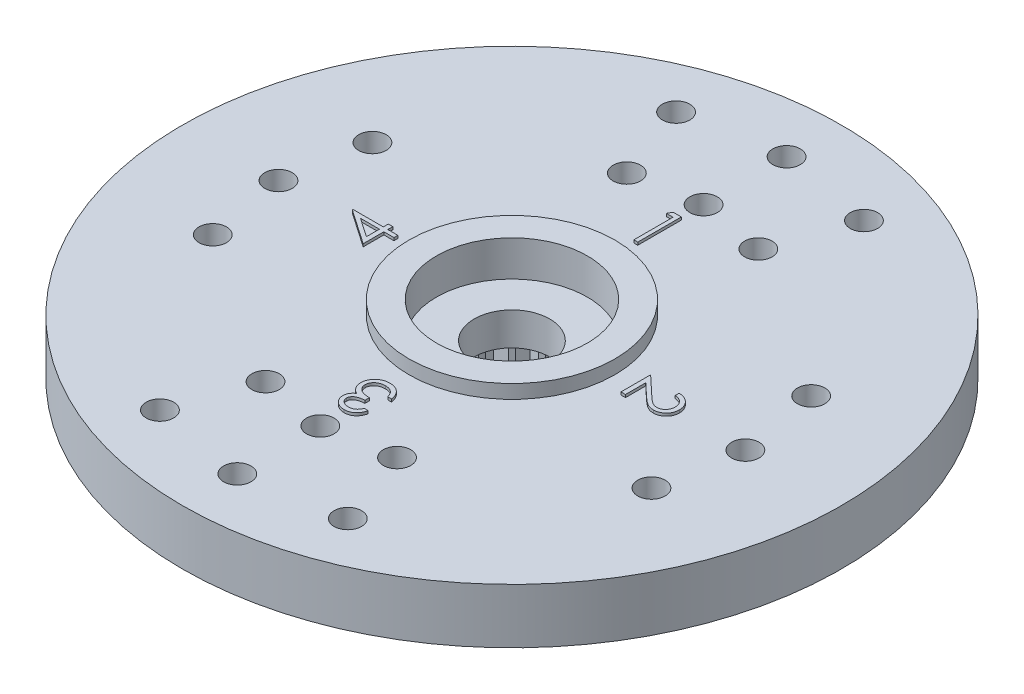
from build123d import *

# Parameters (mm, degrees)
SKETCH1_R           = 12
SKETCH1_R_2         = 1.375
SKETCH1_R_3         = 0.5
BOSS_EXTRUDE1_DEPTH = 2
SKETCH2_R           = 3.75
SKETCH2_R_2         = 2.75
BOSS_EXTRUDE2_DEPTH = 0.5
CUT_EXTRUDE1_START  = -0.8
SKETCH3_R           = 2.75
SKETCH3_R_2         = 1.375
CUT_EXTRUDE1_DEPTH  = 0.8
SKETCH4_R           = 4.5
SKETCH4_R_2         = 2.5
BOSS_EXTRUDE3_DEPTH = 2.5
CUT_EXTRUDE3_START  = -2.5
CUT_EXTRUDE3_DEPTH  = 2.5
BOSS_EXTRUDE4_DEPTH = 0.1


with BuildPart() as part:
    # Sketch1 → Boss-Extrude1 (new body)
    with BuildSketch(Plane(origin=(0, 0, 0), x_dir=(1, 0, 0), z_dir=(0, 1, 0))):
        with Locations(Location((0, 0, 0), (0, 0, 270))):
            Circle(SKETCH1_R)
        with Locations(Location((0, 0, 0), (0, 0, 270))):
            Circle(SKETCH1_R_2, mode=Mode.SUBTRACT)
        with Locations(Location((0, 10, 0), (0, 0, 270))):
            Circle(SKETCH1_R_3, mode=Mode.SUBTRACT)
        with Locations(Location((-3.420201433, 9.396926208, 0), (0, 0, 270))):
            Circle(SKETCH1_R_3, mode=Mode.SUBTRACT)
        with Locations(Location((3.420201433, 9.396926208, 0), (0, 0, 270))):
            Circle(SKETCH1_R_3, mode=Mode.SUBTRACT)
        with Locations(Location((0, 6.977694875, 0), (0, 0, 270))):
            Circle(SKETCH1_R_3, mode=Mode.SUBTRACT)
        with Locations(Location((-2.394141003, 6.577848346, 0), (0, 0, 270))):
            Circle(SKETCH1_R_3, mode=Mode.SUBTRACT)
        with Locations(Location((2.394141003, 6.577848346, 0), (0, 0, 270))):
            Circle(SKETCH1_R_3, mode=Mode.SUBTRACT)
        with Locations(Location((8.5, 0, 0), (0, 0, 270))):
            Circle(SKETCH1_R_3, mode=Mode.SUBTRACT)
        with Locations(Location((7.987387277, 2.907171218, 0), (0, 0, 270))):
            Circle(SKETCH1_R_3, mode=Mode.SUBTRACT)
        with Locations(Location((7.987387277, -2.907171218, 0), (0, 0, 270))):
            Circle(SKETCH1_R_3, mode=Mode.SUBTRACT)
        with Locations(Location((-2.394141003, -6.577848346, 0), (0, 0, 90))):
            Circle(SKETCH1_R_3, mode=Mode.SUBTRACT)
        with Locations(Location((0, -6.977694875, 0), (0, 0, 90))):
            Circle(SKETCH1_R_3, mode=Mode.SUBTRACT)
        with Locations(Location((2.394141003, -6.577848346, 0), (0, 0, 90))):
            Circle(SKETCH1_R_3, mode=Mode.SUBTRACT)
        with Locations(Location((3.420201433, -9.396926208, 0), (0, 0, 90))):
            Circle(SKETCH1_R_3, mode=Mode.SUBTRACT)
        with Locations(Location((0, -10, 0), (0, 0, 90))):
            Circle(SKETCH1_R_3, mode=Mode.SUBTRACT)
        with Locations(Location((-3.420201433, -9.396926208, 0), (0, 0, 90))):
            Circle(SKETCH1_R_3, mode=Mode.SUBTRACT)
        with Locations(Location((-7.987387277, -2.907171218, 0), (0, 0, 90))):
            Circle(SKETCH1_R_3, mode=Mode.SUBTRACT)
        with Locations(Location((-8.5, 0, 0), (0, 0, 90))):
            Circle(SKETCH1_R_3, mode=Mode.SUBTRACT)
        with Locations(Location((-7.987387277, 2.907171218, 0), (0, 0, 90))):
            Circle(SKETCH1_R_3, mode=Mode.SUBTRACT)
    extrude(amount=BOSS_EXTRUDE1_DEPTH)

    # Sketch2 → Boss-Extrude2 (add)
    with BuildSketch(Plane(origin=(0, 2, 0), x_dir=(1, 0, 0), z_dir=(0, 1, 0))):
        with Locations(Location((0, 0, 0), (0, 0, 270))):
            Circle(SKETCH2_R)
        with Locations(Location((0, 0, 0), (0, 0, 270))):
            Circle(SKETCH2_R_2, mode=Mode.SUBTRACT)
    extrude(amount=BOSS_EXTRUDE2_DEPTH)

    # Sketch3 → Cut-Extrude1 (cut)
    with BuildSketch(Plane(origin=(0, 2, 0), x_dir=(1, 0, 0), z_dir=(0, 1, 0)).offset(CUT_EXTRUDE1_START)):
        with Locations(Location((0, 0, 0), (0, 0, 270))):
            Circle(SKETCH3_R)
        with Locations(Location((0, 0, 0), (0, 0, 270))):
            Circle(SKETCH3_R_2, mode=Mode.SUBTRACT)
    extrude(amount=CUT_EXTRUDE1_DEPTH, mode=Mode.SUBTRACT)

    # Sketch4 → Boss-Extrude3 (add)
    with BuildSketch(Plane.XZ):
        with Locations(Location((0, 0, 0), (0, 0, 90))):
            Circle(SKETCH4_R)
        with Locations(Location((0, 0, 0), (0, 0, 270))):
            Circle(SKETCH4_R_2, mode=Mode.SUBTRACT)
    extrude(amount=BOSS_EXTRUDE3_DEPTH)

    # Sketch5 → Cut-Extrude3 (cut)
    with BuildSketch(Plane.XZ.offset(2.5).offset(CUT_EXTRUDE3_START)):
        with BuildLine():
            Line((0.299038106, 2.482050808), (0, 3))
            Line((0, 3), (-0.299038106, 2.482050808))
            ThreePointArc((-0.299038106, 2.482050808), (-0.391086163, 2.469220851), (-0.482593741, 2.452978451))
            Line((-0.482593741, 2.452978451), (-0.927050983, 2.853169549))
            Line((-0.927050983, 2.853169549), (-1.051398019, 2.268162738))
            ThreePointArc((-1.051398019, 2.268162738), (-1.134976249, 2.22751631), (-1.216985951, 2.183791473))
            Line((-1.216985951, 2.183791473), (-1.763355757, 2.427050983))
            Line((-1.763355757, 2.427050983), (-1.70083977, 1.832251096))
            ThreePointArc((-1.70083977, 1.832251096), (-1.767766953, 1.767766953), (-1.832251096, 1.70083977))
            Line((-1.832251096, 1.70083977), (-2.427050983, 1.763355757))
            Line((-2.427050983, 1.763355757), (-2.183791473, 1.216985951))
            ThreePointArc((-2.183791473, 1.216985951), (-2.22751631, 1.134976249), (-2.268162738, 1.051398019))
            Line((-2.268162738, 1.051398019), (-2.853169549, 0.927050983))
            Line((-2.853169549, 0.927050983), (-2.452978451, 0.482593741))
            ThreePointArc((-2.452978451, 0.482593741), (-2.469220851, 0.391086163), (-2.482050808, 0.299038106))
            Line((-2.482050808, 0.299038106), (-3, 0))
            Line((-3, 0), (-2.482050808, -0.299038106))
            ThreePointArc((-2.482050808, -0.299038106), (-2.469220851, -0.391086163), (-2.452978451, -0.482593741))
            Line((-2.452978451, -0.482593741), (-2.853169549, -0.927050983))
            Line((-2.853169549, -0.927050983), (-2.268162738, -1.051398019))
            ThreePointArc((-2.268162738, -1.051398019), (-2.22751631, -1.134976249), (-2.183791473, -1.216985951))
            Line((-2.183791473, -1.216985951), (-2.427050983, -1.763355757))
            Line((-2.427050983, -1.763355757), (-1.832251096, -1.70083977))
            ThreePointArc((-1.832251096, -1.70083977), (-1.767766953, -1.767766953), (-1.70083977, -1.832251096))
            Line((-1.70083977, -1.832251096), (-1.763355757, -2.427050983))
            Line((-1.763355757, -2.427050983), (-1.216985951, -2.183791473))
            ThreePointArc((-1.216985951, -2.183791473), (-1.134976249, -2.22751631), (-1.051398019, -2.268162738))
            Line((-1.051398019, -2.268162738), (-0.927050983, -2.853169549))
            Line((-0.927050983, -2.853169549), (-0.482593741, -2.452978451))
            ThreePointArc((-0.482593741, -2.452978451), (-0.391086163, -2.469220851), (-0.299038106, -2.482050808))
            Line((-0.299038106, -2.482050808), (0, -3))
            Line((0, -3), (0.299038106, -2.482050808))
            ThreePointArc((0.299038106, -2.482050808), (0.391086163, -2.469220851), (0.482593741, -2.452978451))
            Line((0.482593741, -2.452978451), (0.927050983, -2.853169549))
            Line((0.927050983, -2.853169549), (1.051398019, -2.268162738))
            ThreePointArc((1.051398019, -2.268162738), (1.134976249, -2.22751631), (1.216985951, -2.183791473))
            Line((1.216985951, -2.183791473), (1.763355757, -2.427050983))
            Line((1.763355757, -2.427050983), (1.70083977, -1.832251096))
            ThreePointArc((1.70083977, -1.832251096), (1.767766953, -1.767766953), (1.832251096, -1.70083977))
            Line((1.832251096, -1.70083977), (2.427050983, -1.763355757))
            Line((2.427050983, -1.763355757), (2.183791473, -1.216985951))
            ThreePointArc((2.183791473, -1.216985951), (2.22751631, -1.134976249), (2.268162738, -1.051398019))
            Line((2.268162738, -1.051398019), (2.853169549, -0.927050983))
            Line((2.853169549, -0.927050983), (2.452978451, -0.482593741))
            ThreePointArc((2.452978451, -0.482593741), (2.469220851, -0.391086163), (2.482050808, -0.299038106))
            Line((2.482050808, -0.299038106), (3, 0))
            Line((3, 0), (2.482050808, 0.299038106))
            ThreePointArc((2.482050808, 0.299038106), (2.469220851, 0.391086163), (2.452978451, 0.482593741))
            Line((2.452978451, 0.482593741), (2.853169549, 0.927050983))
            Line((2.853169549, 0.927050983), (2.268162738, 1.051398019))
            ThreePointArc((2.268162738, 1.051398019), (2.22751631, 1.134976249), (2.183791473, 1.216985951))
            Line((2.183791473, 1.216985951), (2.427050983, 1.763355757))
            Line((2.427050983, 1.763355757), (1.832251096, 1.70083977))
            ThreePointArc((1.832251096, 1.70083977), (1.767766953, 1.767766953), (1.70083977, 1.832251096))
            Line((1.70083977, 1.832251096), (1.763355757, 2.427050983))
            Line((1.763355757, 2.427050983), (1.216985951, 2.183791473))
            ThreePointArc((1.216985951, 2.183791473), (1.134976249, 2.22751631), (1.051398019, 2.268162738))
            Line((1.051398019, 2.268162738), (0.927050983, 2.853169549))
            Line((0.927050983, 2.853169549), (0.482593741, 2.452978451))
            ThreePointArc((0.482593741, 2.452978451), (0.391086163, 2.469220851), (0.299038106, 2.482050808))
        make_face()
    extrude(amount=CUT_EXTRUDE3_DEPTH, mode=Mode.SUBTRACT)

    # Sketch6 → Boss-Extrude4 (add)
    # profile 1 of 4: a face of its own
    with BuildSketch(Plane(origin=(0, 2, 0), x_dir=(1, 0, 0), z_dir=(0, 1, 0))):
        Polygon((-0.212111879, 6.0875), (0.081410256, 6.0875), (0.081410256, 4.5), (-0.061057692, 4.5), (-0.061057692, 5.924679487), (-0.305288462, 5.924679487), align=None)
    # profile 2 of 4: a face of its own
    with BuildSketch(Plane(origin=(0, 2, 0), x_dir=(1, 0, 0), z_dir=(0, 1, 0))):
        with BuildLine():
            Line((5.599038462, 0.34599359), (5.599038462, 0.488461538))
            add(Edge.make_bspline(
                [(5.599038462, 0.488461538), (5.617939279, 0.487533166), (5.655059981, 0.485709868), (5.709180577, 0.477167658), (5.760917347, 0.46495614), (5.809826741, 0.447649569), (5.856493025, 0.426277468), (5.900296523, 0.40011183), (5.941671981, 0.369710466), (5.979836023, 0.335129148), (6.014722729, 0.29760523), (6.045167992, 0.25736354), (6.070596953, 0.214817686), (6.091970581, 0.170336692), (6.107994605, 0.123406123), (6.119889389, 0.074474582), (6.127044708, 0.023320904), (6.12781392, -0.011531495), (6.128205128, -0.029256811)],
                knots=[0, 0, 0, 0, 1.100776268, 2.161895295, 3.184016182, 4.190939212, 5.176500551, 6.166955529, 7.155448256, 8.160289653, 9.16017456, 10.133824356, 11.091467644, 12.04088621, 13.000931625, 13.972173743, 14.968683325, 16, 16, 16, 16], degree=3))
            add(Edge.make_bspline(
                [(6.128205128, -0.029256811), (6.127797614, -0.046664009), (6.126996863, -0.080868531), (6.120120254, -0.130789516), (6.109349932, -0.178313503), (6.094239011, -0.223347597), (6.073926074, -0.265532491), (6.049525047, -0.305185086), (6.02130391, -0.342777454), (5.988078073, -0.376616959), (5.952607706, -0.407690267), (5.914739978, -0.434497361), (5.875628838, -0.457454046), (5.834976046, -0.476589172), (5.79239883, -0.490675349), (5.748517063, -0.501369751), (5.702876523, -0.507414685), (5.671985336, -0.50834243), (5.656280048, -0.508814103)],
                knots=[0, 0, 0, 0, 1.111607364, 2.184268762, 3.212621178, 4.221274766, 5.211760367, 6.196651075, 7.1921475, 8.207485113, 9.220403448, 10.201281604, 11.166441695, 12.114753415, 13.065576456, 14.026450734, 14.996634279, 16, 16, 16, 16], degree=3))
            add(Edge.make_bspline(
                [(5.656280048, -0.508814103), (5.634169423, -0.508046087), (5.590336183, -0.506523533), (5.525922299, -0.493499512), (5.463513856, -0.473158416), (5.413286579, -0.448666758), (5.372812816, -0.423959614), (5.339489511, -0.401694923), (5.30360953, -0.375630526), (5.265293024, -0.345387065), (5.224239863, -0.311590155), (5.180474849, -0.273933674), (5.134450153, -0.232149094), (5.103015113, -0.202821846), (5.086726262, -0.1876252)],
                knots=[0, 0, 0, 0, 1.184426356, 2.348067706, 3.509069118, 4.696110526, 5.333549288, 6.050745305, 6.844228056, 7.710549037, 8.667450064, 9.695053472, 10.805634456, 12, 12, 12, 12], degree=3))
            Line((5.086726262, -0.1876252), (4.662820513, 0.209567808))
            Line((4.662820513, 0.209567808), (4.662820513, -0.529166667))
            Line((4.662820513, -0.529166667), (4.5, -0.529166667))
            Line((4.5, -0.529166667), (4.5, 0.549519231))
            Line((4.5, 0.549519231), (5.15700621, -0.066145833))
            add(Edge.make_bspline(
                [(5.15700621, -0.066145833), (5.172652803, -0.081136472), (5.202706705, -0.10993042), (5.246597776, -0.15063927), (5.287268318, -0.187261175), (5.324898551, -0.219820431), (5.359275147, -0.248343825), (5.390667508, -0.272740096), (5.418806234, -0.293117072), (5.451862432, -0.31471242), (5.492269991, -0.335305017), (5.541401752, -0.353403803), (5.592090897, -0.364360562), (5.626334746, -0.36568164), (5.643559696, -0.366346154)],
                knots=[0, 0, 0, 0, 1.329530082, 2.553755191, 3.672934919, 4.687409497, 5.60679272, 6.413407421, 7.126401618, 7.737995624, 8.834647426, 9.90044882, 10.943907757, 12, 12, 12, 12], degree=3))
            add(Edge.make_bspline(
                [(5.643559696, -0.366346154), (5.654392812, -0.366060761), (5.675742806, -0.365498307), (5.707024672, -0.360440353), (5.737316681, -0.353009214), (5.766244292, -0.341555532), (5.794376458, -0.327794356), (5.820857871, -0.310213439), (5.846591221, -0.290123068), (5.87069413, -0.266819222), (5.892776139, -0.241235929), (5.912335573, -0.214204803), (5.928681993, -0.185607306), (5.94208205, -0.155562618), (5.952593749, -0.124154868), (5.959877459, -0.091323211), (5.964450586, -0.057158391), (5.965069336, -0.033829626), (5.965384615, -0.021942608)],
                knots=[0, 0, 0, 0, 0.991504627, 1.954065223, 2.895985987, 3.842598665, 4.797835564, 5.759220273, 6.74786863, 7.784730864, 8.824135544, 9.839918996, 10.835834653, 11.835434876, 12.84861661, 13.863796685, 14.911511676, 16, 16, 16, 16], degree=3))
            add(Edge.make_bspline(
                [(5.965384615, -0.021942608), (5.965060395, -0.009527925), (5.964423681, 0.014852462), (5.959967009, 0.050647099), (5.952285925, 0.084797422), (5.941755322, 0.117372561), (5.928497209, 0.148403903), (5.911665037, 0.177610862), (5.891915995, 0.205260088), (5.869403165, 0.231300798), (5.844219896, 0.255228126), (5.816492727, 0.276692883), (5.786041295, 0.295000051), (5.753553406, 0.311228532), (5.718165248, 0.323645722), (5.680734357, 0.334259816), (5.64072893, 0.341970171), (5.613166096, 0.344630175), (5.599038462, 0.34599359)],
                knots=[0, 0, 0, 0, 1.031212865, 2.025131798, 2.990757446, 3.934781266, 4.865570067, 5.788494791, 6.729227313, 7.684356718, 8.643577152, 9.610526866, 10.590658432, 11.59095419, 12.621640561, 13.700587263, 14.82141059, 16, 16, 16, 16], degree=3))
        make_face()
    # profile 3 of 4: a face of its own
    with BuildSketch(Plane(origin=(0, 2, 0), x_dir=(1, 0, 0), z_dir=(0, 1, 0))):
        with BuildLine():
            Line((0.34599359, -5.721153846), (0.488461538, -5.721153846))
            add(Edge.make_bspline(
                [(0.488461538, -5.721153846), (0.484601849, -5.737134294), (0.477056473, -5.768374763), (0.461318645, -5.813009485), (0.444173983, -5.855247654), (0.423586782, -5.894298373), (0.401131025, -5.930946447), (0.37540322, -5.964360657), (0.347590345, -5.995390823), (0.316826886, -6.022928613), (0.284564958, -6.04786494), (0.250349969, -6.069126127), (0.2148703, -6.08741601), (0.177880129, -6.102483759), (0.139269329, -6.113834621), (0.099386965, -6.122070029), (0.05812852, -6.127418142), (0.030121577, -6.127940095), (0.015900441, -6.128205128)],
                knots=[0, 0, 0, 0, 1.162005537, 2.271625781, 3.343758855, 4.383309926, 5.390229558, 6.379919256, 7.361854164, 8.333198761, 9.295911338, 10.242430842, 11.177959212, 12.116337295, 13.062827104, 14.020064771, 14.994644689, 16, 16, 16, 16], degree=3))
            add(Edge.make_bspline(
                [(0.015900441, -6.128205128), (-0.004819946, -6.127579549), (-0.045808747, -6.126342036), (-0.106026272, -6.115041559), (-0.164095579, -6.097159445), (-0.21938106, -6.072451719), (-0.270733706, -6.041977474), (-0.316424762, -6.005707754), (-0.355834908, -5.964342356), (-0.388897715, -5.918652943), (-0.414785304, -5.86982348), (-0.43387448, -5.819567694), (-0.445495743, -5.7680048), (-0.447001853, -5.733189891), (-0.44775641, -5.715747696)],
                knots=[0, 0, 0, 0, 1.083050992, 2.142477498, 3.193116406, 4.255571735, 5.30263384, 6.308962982, 7.297363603, 8.282367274, 9.249857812, 10.179914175, 11.08814088, 12, 12, 12, 12], degree=3))
            add(Edge.make_bspline(
                [(-0.44775641, -5.715747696), (-0.447228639, -5.698962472), (-0.446195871, -5.666116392), (-0.437426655, -5.618164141), (-0.422669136, -5.572969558), (-0.402226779, -5.530342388), (-0.375764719, -5.490552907), (-0.343709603, -5.453511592), (-0.305835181, -5.419054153), (-0.277133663, -5.399314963), (-0.262357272, -5.389152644)],
                knots=[0, 0, 0, 0, 1.024540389, 2.004866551, 2.965041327, 3.920577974, 4.882998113, 5.874504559, 6.905732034, 8, 8, 8, 8], degree=3))
            add(Edge.make_bspline(
                [(-0.262357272, -5.389152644), (-0.279266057, -5.38102782), (-0.312821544, -5.364904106), (-0.358097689, -5.332780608), (-0.399825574, -5.296601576), (-0.422822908, -5.268052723), (-0.43440004, -5.253680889)],
                knots=[0, 0, 0, 0, 1.015663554, 2.015584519, 3.001021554, 4, 4, 4, 4], degree=3))
            add(Edge.make_bspline(
                [(-0.43440004, -5.253680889), (-0.442041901, -5.243223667), (-0.457200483, -5.222480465), (-0.475858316, -5.189110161), (-0.492978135, -5.155480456), (-0.505577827, -5.120269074), (-0.516450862, -5.084607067), (-0.523604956, -5.047730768), (-0.528197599, -5.009990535), (-0.5288425, -4.984446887), (-0.529166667, -4.971607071)],
                knots=[0, 0, 0, 0, 1.02516404, 2.033540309, 3.025129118, 4.011046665, 4.991655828, 5.976607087, 6.982917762, 8, 8, 8, 8], degree=3))
            add(Edge.make_bspline(
                [(-0.529166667, -4.971607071), (-0.528350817, -4.94937866), (-0.526722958, -4.905026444), (-0.512235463, -4.839481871), (-0.489636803, -4.775530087), (-0.458141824, -4.71407805), (-0.418998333, -4.656756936), (-0.372686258, -4.605322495), (-0.319156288, -4.561514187), (-0.259966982, -4.524586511), (-0.195593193, -4.495321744), (-0.127013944, -4.474234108), (-0.05463527, -4.461584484), (-0.005138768, -4.460066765), (0.020034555, -4.459294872)],
                knots=[0, 0, 0, 0, 0.955619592, 1.906742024, 2.874954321, 3.868585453, 4.869520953, 5.854611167, 6.836527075, 7.836578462, 8.849204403, 9.870874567, 10.917152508, 12, 12, 12, 12], degree=3))
            add(Edge.make_bspline(
                [(0.020034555, -4.459294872), (0.037005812, -4.459692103), (0.070399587, -4.460473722), (0.11951096, -4.465721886), (0.166290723, -4.475567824), (0.211193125, -4.487950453), (0.253540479, -4.505070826), (0.293941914, -4.525481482), (0.332220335, -4.549705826), (0.36814842, -4.577784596), (0.401687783, -4.60921458), (0.431983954, -4.644517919), (0.459372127, -4.683035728), (0.48367828, -4.725114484), (0.50500471, -4.770636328), (0.52289247, -4.819783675), (0.538510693, -4.872175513), (0.545786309, -4.908676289), (0.549519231, -4.927403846)],
                knots=[0, 0, 0, 0, 1.048603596, 2.063302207, 3.045874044, 3.999447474, 4.937100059, 5.862643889, 6.7929026, 7.7308982, 8.676022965, 9.627908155, 10.600123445, 11.591992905, 12.626222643, 13.701663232, 14.820785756, 16, 16, 16, 16], degree=3))
            Line((0.549519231, -4.927403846), (0.407051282, -4.927403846))
            add(Edge.make_bspline(
                [(0.407051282, -4.927403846), (0.403339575, -4.915180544), (0.396119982, -4.891405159), (0.383830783, -4.857187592), (0.369829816, -4.825819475), (0.354809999, -4.797070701), (0.339035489, -4.770658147), (0.321384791, -4.747280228), (0.303165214, -4.725910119), (0.289431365, -4.713870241), (0.282709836, -4.707977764)],
                knots=[0, 0, 0, 0, 1.198163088, 2.33053128, 3.407730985, 4.417276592, 5.372219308, 6.28897303, 7.162600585, 8, 8, 8, 8], degree=3))
            add(Edge.make_bspline(
                [(0.282709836, -4.707977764), (0.273820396, -4.701127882), (0.256068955, -4.68744926), (0.227160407, -4.669943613), (0.196651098, -4.654959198), (0.164286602, -4.642779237), (0.130062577, -4.63363652), (0.094117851, -4.627056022), (0.056393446, -4.622711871), (0.030647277, -4.622317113), (0.017490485, -4.622115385)],
                knots=[0, 0, 0, 0, 0.946083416, 1.889246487, 2.84504177, 3.809995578, 4.801312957, 5.829064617, 6.89060985, 8, 8, 8, 8], degree=3))
            add(Edge.make_bspline(
                [(0.017490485, -4.622115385), (0.002634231, -4.622394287), (-0.026415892, -4.622939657), (-0.068801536, -4.627969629), (-0.109137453, -4.635263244), (-0.147012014, -4.646671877), (-0.182940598, -4.660358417), (-0.216121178, -4.678276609), (-0.247529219, -4.69851231), (-0.276244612, -4.722050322), (-0.302132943, -4.747492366), (-0.324503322, -4.774484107), (-0.343878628, -4.802188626), (-0.35945314, -4.831252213), (-0.371773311, -4.861389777), (-0.380155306, -4.892714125), (-0.385984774, -4.924961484), (-0.386459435, -4.946882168), (-0.386698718, -4.957932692)],
                knots=[0, 0, 0, 0, 1.216990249, 2.379719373, 3.493992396, 4.571561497, 5.616923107, 6.638958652, 7.655775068, 8.674704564, 9.676001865, 10.625896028, 11.54399481, 12.441854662, 13.322657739, 14.20572845, 15.095482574, 16, 16, 16, 16], degree=3))
            add(Edge.make_bspline(
                [(-0.386698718, -4.957932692), (-0.386003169, -4.972723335), (-0.384615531, -5.002231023), (-0.374065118, -5.0456597), (-0.356555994, -5.087519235), (-0.332520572, -5.127261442), (-0.302560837, -5.163663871), (-0.268092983, -5.196247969), (-0.228381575, -5.223379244), (-0.191624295, -5.242072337), (-0.158981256, -5.254526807), (-0.131102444, -5.263260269), (-0.099863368, -5.270241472), (-0.06563939, -5.276994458), (-0.028286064, -5.282655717), (0.012230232, -5.287397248), (0.055925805, -5.291185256), (0.086174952, -5.292877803), (0.101762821, -5.29375)],
                knots=[0, 0, 0, 0, 1.070440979, 2.135555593, 3.216243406, 4.345886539, 5.486149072, 6.621334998, 7.769144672, 8.957074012, 9.598644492, 10.297969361, 11.070758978, 11.915404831, 12.824182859, 13.805940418, 14.869366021, 16, 16, 16, 16], degree=3))
            Line((0.101762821, -5.29375), (0.101762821, -5.456570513))
            add(Edge.make_bspline(
                [(0.101762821, -5.456570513), (0.082130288, -5.456953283), (0.043688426, -5.457702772), (-0.012623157, -5.464900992), (-0.066305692, -5.47658472), (-0.116551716, -5.492896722), (-0.162112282, -5.512755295), (-0.202016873, -5.53498931), (-0.234829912, -5.560639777), (-0.261139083, -5.588494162), (-0.280652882, -5.618558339), (-0.295056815, -5.64975068), (-0.303576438, -5.682651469), (-0.304715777, -5.70510004), (-0.305288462, -5.716383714)],
                knots=[0, 0, 0, 0, 1.321816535, 2.58820849, 3.816448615, 5.017641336, 6.139869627, 7.160068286, 8.085608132, 8.934319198, 9.728416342, 10.48890201, 11.240453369, 12, 12, 12, 12], degree=3))
            add(Edge.make_bspline(
                [(-0.305288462, -5.716383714), (-0.305104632, -5.724675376), (-0.304738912, -5.741171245), (-0.299942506, -5.765346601), (-0.293068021, -5.788783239), (-0.283080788, -5.811207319), (-0.270164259, -5.832690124), (-0.254537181, -5.853310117), (-0.236159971, -5.8732642), (-0.215151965, -5.892112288), (-0.191706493, -5.9090759), (-0.166764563, -5.924198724), (-0.140228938, -5.936914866), (-0.112272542, -5.947455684), (-0.082744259, -5.95537096), (-0.051799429, -5.961057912), (-0.019374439, -5.964612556), (0.002746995, -5.965124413), (0.013992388, -5.965384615)],
                knots=[0, 0, 0, 0, 0.884246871, 1.759167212, 2.622361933, 3.489113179, 4.372562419, 5.294145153, 6.247651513, 7.265905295, 8.30305477, 9.334068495, 10.37719476, 11.441246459, 12.52060732, 13.637552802, 14.799054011, 16, 16, 16, 16], degree=3))
            add(Edge.make_bspline(
                [(0.013992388, -5.965384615), (0.032068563, -5.964754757), (0.067375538, -5.963524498), (0.118264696, -5.952711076), (0.16552422, -5.935578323), (0.201526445, -5.914890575), (0.228156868, -5.894539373), (0.24755157, -5.877031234), (0.266250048, -5.85718059), (0.283518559, -5.83444296), (0.300391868, -5.809600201), (0.31670886, -5.782515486), (0.331945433, -5.752802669), (0.341220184, -5.73190776), (0.34599359, -5.721153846)],
                knots=[0, 0, 0, 0, 1.4727372, 2.876598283, 4.222346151, 5.558423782, 6.24313385, 6.953189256, 7.68715613, 8.463578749, 9.278833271, 10.135787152, 11.040551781, 12, 12, 12, 12], degree=3))
        make_face()
    # profile 4 of 4: a face of its own
    with BuildSketch(Plane(origin=(0, 2, 0), x_dir=(1, 0, 0), z_dir=(0, 1, 0))):
        Polygon((-6.128205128, 0.317054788), (-6.128205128, 0.34599359), (-5.029166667, 0.34599359), (-5.029166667, 0.529166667), (-4.866346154, 0.529166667), (-4.866346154, 0.34599359), (-4.5, 0.34599359), (-4.5, 0.203525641), (-4.866346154, 0.203525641), (-4.866346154, -0.549519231), align=None)
        Polygon((-5.029166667, 0.203525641), (-5.718609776, 0.203525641), (-5.029166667, -0.269671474), align=None, mode=Mode.SUBTRACT)
    extrude(amount=BOSS_EXTRUDE4_DEPTH)


solid = part.part
